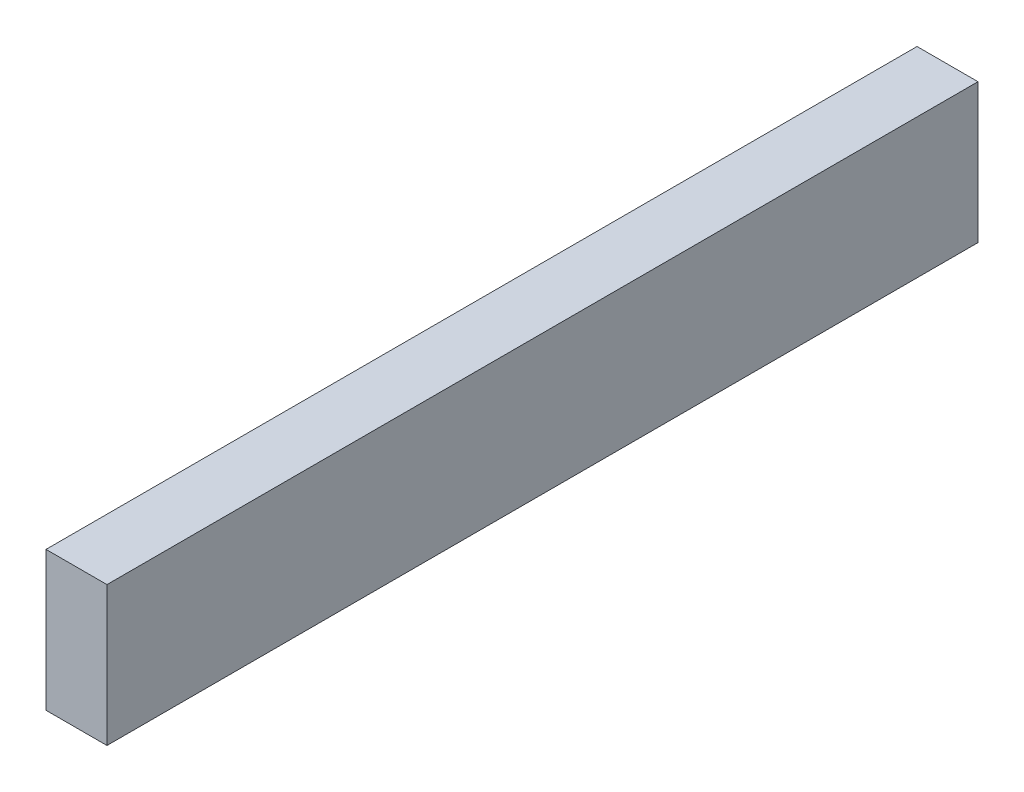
ISO-10303-21;
HEADER;
FILE_DESCRIPTION(('STEP AP214'),'2;1');
FILE_NAME('part.step','',(''),(''),'','','');
FILE_SCHEMA(('AUTOMOTIVE_DESIGN { 1 0 10303 214 1 1 1 1 }'));
ENDSEC;
DATA;
#1=APPLICATION_CONTEXT('core data for automotive mechanical design processes');
#2=APPLICATION_PROTOCOL_DEFINITION('international standard','automotive_design',2000,#1);
#3=PRODUCT_CONTEXT('',#1,'mechanical');
#4=PRODUCT('Part','Part','',(#3));
#5=PRODUCT_RELATED_PRODUCT_CATEGORY('part','',(#4));
#6=PRODUCT_DEFINITION_FORMATION('','',#4);
#7=PRODUCT_DEFINITION_CONTEXT('part definition',#1,'design');
#8=PRODUCT_DEFINITION('design','',#6,#7);
#9=PRODUCT_DEFINITION_SHAPE('','',#8);
#10=(LENGTH_UNIT() NAMED_UNIT(*) SI_UNIT(.MILLI.,.METRE.));
#11=(NAMED_UNIT(*) PLANE_ANGLE_UNIT() SI_UNIT($,.RADIAN.));
#12=(NAMED_UNIT(*) SI_UNIT($,.STERADIAN.) SOLID_ANGLE_UNIT());
#13=UNCERTAINTY_MEASURE_WITH_UNIT(LENGTH_MEASURE(1.E-05),#10,'distance_accuracy_value','');
#14=(GEOMETRIC_REPRESENTATION_CONTEXT(3) GLOBAL_UNCERTAINTY_ASSIGNED_CONTEXT((#13)) GLOBAL_UNIT_ASSIGNED_CONTEXT((#10,
#11,#12)) REPRESENTATION_CONTEXT('',''));
#15=CARTESIAN_POINT('',(0.,0.,0.));
#16=DIRECTION('',(0.,0.,1.));
#17=DIRECTION('',(1.,0.,0.));
#18=AXIS2_PLACEMENT_3D('',#15,#16,#17);
#19=CARTESIAN_POINT('',(-58.6347122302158,-18.0919064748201,200.));
#20=DIRECTION('',(1.,0.,0.));
#21=DIRECTION('',(0.,0.,-1.));
#22=AXIS2_PLACEMENT_3D('',#19,#20,#21);
#23=PLANE('',#22);
#24=DIRECTION('',(0.,-1.,0.));
#25=VECTOR('',#24,1.);
#26=CARTESIAN_POINT('',(-58.6347122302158,-18.0919064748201,0.));
#27=LINE('',#26,#25);
#28=CARTESIAN_POINT('',(-58.6347122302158,-18.0919064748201,0.));
#29=VERTEX_POINT('',#28);
#30=CARTESIAN_POINT('',(-58.6347122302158,-50.0919064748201,0.));
#31=VERTEX_POINT('',#30);
#32=EDGE_CURVE('E96',#29,#31,#27,.T.);
#33=ORIENTED_EDGE('',*,*,#32,.T.);
#34=DIRECTION('',(0.,0.,-1.));
#35=VECTOR('',#34,1.);
#36=CARTESIAN_POINT('',(-58.6347122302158,-50.0919064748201,200.));
#37=LINE('',#36,#35);
#38=CARTESIAN_POINT('',(-58.6347122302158,-50.0919064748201,200.));
#39=VERTEX_POINT('',#38);
#40=EDGE_CURVE('E11',#39,#31,#37,.T.);
#41=ORIENTED_EDGE('',*,*,#40,.F.);
#42=DIRECTION('',(0.,-1.,0.));
#43=VECTOR('',#42,1.);
#44=CARTESIAN_POINT('',(-58.6347122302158,-18.0919064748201,200.));
#45=LINE('',#44,#43);
#46=CARTESIAN_POINT('',(-58.6347122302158,-18.0919064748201,200.));
#47=VERTEX_POINT('',#46);
#48=EDGE_CURVE('E84',#47,#39,#45,.T.);
#49=ORIENTED_EDGE('',*,*,#48,.F.);
#50=DIRECTION('',(0.,0.,-1.));
#51=VECTOR('',#50,1.);
#52=CARTESIAN_POINT('',(-58.6347122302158,-18.0919064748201,200.));
#53=LINE('',#52,#51);
#54=EDGE_CURVE('E92',#47,#29,#53,.T.);
#55=ORIENTED_EDGE('',*,*,#54,.T.);
#56=EDGE_LOOP('',(#33,#41,#49,#55));
#57=FACE_BOUND('',#56,.T.);
#58=ADVANCED_FACE('F33',(#57),#23,.F.);
#59=CARTESIAN_POINT('',(-58.6347122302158,-50.0919064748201,200.));
#60=DIRECTION('',(0.,1.,0.));
#61=DIRECTION('',(0.,0.,1.));
#62=AXIS2_PLACEMENT_3D('',#59,#60,#61);
#63=PLANE('',#62);
#64=DIRECTION('',(1.,0.,0.));
#65=VECTOR('',#64,1.);
#66=CARTESIAN_POINT('',(-58.6347122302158,-50.0919064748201,0.));
#67=LINE('',#66,#65);
#68=CARTESIAN_POINT('',(-44.6347122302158,-50.0919064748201,0.));
#69=VERTEX_POINT('',#68);
#70=EDGE_CURVE('E88',#31,#69,#67,.T.);
#71=ORIENTED_EDGE('',*,*,#70,.T.);
#72=DIRECTION('',(0.,0.,-1.));
#73=VECTOR('',#72,1.);
#74=CARTESIAN_POINT('',(-44.6347122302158,-50.0919064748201,200.));
#75=LINE('',#74,#73);
#76=CARTESIAN_POINT('',(-44.6347122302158,-50.0919064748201,200.));
#77=VERTEX_POINT('',#76);
#78=EDGE_CURVE('E41',#77,#69,#75,.T.);
#79=ORIENTED_EDGE('',*,*,#78,.F.);
#80=DIRECTION('',(1.,0.,0.));
#81=VECTOR('',#80,1.);
#82=CARTESIAN_POINT('',(-58.6347122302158,-50.0919064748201,200.));
#83=LINE('',#82,#81);
#84=EDGE_CURVE('E79',#39,#77,#83,.T.);
#85=ORIENTED_EDGE('',*,*,#84,.F.);
#86=ORIENTED_EDGE('',*,*,#40,.T.);
#87=EDGE_LOOP('',(#71,#79,#85,#86));
#88=FACE_BOUND('',#87,.T.);
#89=ADVANCED_FACE('F87',(#88),#63,.F.);
#90=CARTESIAN_POINT('',(-44.6347122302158,-18.0919064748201,200.));
#91=DIRECTION('',(-1.,0.,0.));
#92=DIRECTION('',(0.,-1.,0.));
#93=AXIS2_PLACEMENT_3D('',#90,#91,#92);
#94=PLANE('',#93);
#95=DIRECTION('',(0.,1.,0.));
#96=VECTOR('',#95,1.);
#97=CARTESIAN_POINT('',(-44.6347122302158,-18.0919064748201,0.));
#98=LINE('',#97,#96);
#99=CARTESIAN_POINT('',(-44.6347122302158,-18.0919064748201,0.));
#100=VERTEX_POINT('',#99);
#101=EDGE_CURVE('E66',#69,#100,#98,.T.);
#102=ORIENTED_EDGE('',*,*,#101,.T.);
#103=DIRECTION('',(0.,0.,-1.));
#104=VECTOR('',#103,1.);
#105=CARTESIAN_POINT('',(-44.6347122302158,-18.0919064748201,200.));
#106=LINE('',#105,#104);
#107=CARTESIAN_POINT('',(-44.6347122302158,-18.0919064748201,200.));
#108=VERTEX_POINT('',#107);
#109=EDGE_CURVE('E89',#108,#100,#106,.T.);
#110=ORIENTED_EDGE('',*,*,#109,.F.);
#111=DIRECTION('',(0.,1.,0.));
#112=VECTOR('',#111,1.);
#113=CARTESIAN_POINT('',(-44.6347122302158,-18.0919064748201,200.));
#114=LINE('',#113,#112);
#115=EDGE_CURVE('E82',#77,#108,#114,.T.);
#116=ORIENTED_EDGE('',*,*,#115,.F.);
#117=ORIENTED_EDGE('',*,*,#78,.T.);
#118=EDGE_LOOP('',(#102,#110,#116,#117));
#119=FACE_BOUND('',#118,.T.);
#120=ADVANCED_FACE('F90',(#119),#94,.F.);
#121=CARTESIAN_POINT('',(-58.6347122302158,-18.0919064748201,200.));
#122=DIRECTION('',(0.,-1.,0.));
#123=DIRECTION('',(0.,0.,-1.));
#124=AXIS2_PLACEMENT_3D('',#121,#122,#123);
#125=PLANE('',#124);
#126=DIRECTION('',(-1.,0.,0.));
#127=VECTOR('',#126,1.);
#128=CARTESIAN_POINT('',(-58.6347122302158,-18.0919064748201,0.));
#129=LINE('',#128,#127);
#130=EDGE_CURVE('E72',#100,#29,#129,.T.);
#131=ORIENTED_EDGE('',*,*,#130,.T.);
#132=ORIENTED_EDGE('',*,*,#54,.F.);
#133=DIRECTION('',(-1.,0.,0.));
#134=VECTOR('',#133,1.);
#135=CARTESIAN_POINT('',(-58.6347122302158,-18.0919064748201,200.));
#136=LINE('',#135,#134);
#137=EDGE_CURVE('E49',#108,#47,#136,.T.);
#138=ORIENTED_EDGE('',*,*,#137,.F.);
#139=ORIENTED_EDGE('',*,*,#109,.T.);
#140=EDGE_LOOP('',(#131,#132,#138,#139));
#141=FACE_BOUND('',#140,.T.);
#142=ADVANCED_FACE('F103',(#141),#125,.F.);
#143=CARTESIAN_POINT('',(-58.6347122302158,-50.0919064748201,200.));
#144=DIRECTION('',(0.,0.,1.));
#145=DIRECTION('',(1.,0.,0.));
#146=AXIS2_PLACEMENT_3D('',#143,#144,#145);
#147=PLANE('',#146);
#148=ORIENTED_EDGE('',*,*,#48,.T.);
#149=ORIENTED_EDGE('',*,*,#84,.T.);
#150=ORIENTED_EDGE('',*,*,#115,.T.);
#151=ORIENTED_EDGE('',*,*,#137,.T.);
#152=EDGE_LOOP('',(#148,#149,#150,#151));
#153=FACE_BOUND('',#152,.T.);
#154=ADVANCED_FACE('F80',(#153),#147,.T.);
#155=CARTESIAN_POINT('',(-58.6347122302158,-50.0919064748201,0.));
#156=DIRECTION('',(0.,0.,1.));
#157=DIRECTION('',(1.,0.,0.));
#158=AXIS2_PLACEMENT_3D('',#155,#156,#157);
#159=PLANE('',#158);
#160=ORIENTED_EDGE('',*,*,#32,.F.);
#161=ORIENTED_EDGE('',*,*,#130,.F.);
#162=ORIENTED_EDGE('',*,*,#101,.F.);
#163=ORIENTED_EDGE('',*,*,#70,.F.);
#164=EDGE_LOOP('',(#160,#161,#162,#163));
#165=FACE_BOUND('',#164,.T.);
#166=ADVANCED_FACE('F106',(#165),#159,.F.);
#167=CLOSED_SHELL('',(#58,#89,#120,#142,#154,#166));
#168=MANIFOLD_SOLID_BREP('B2',#167);
#169=ADVANCED_BREP_SHAPE_REPRESENTATION('',(#18,#168),#14);
#170=SHAPE_DEFINITION_REPRESENTATION(#9,#169);
ENDSEC;
END-ISO-10303-21;
